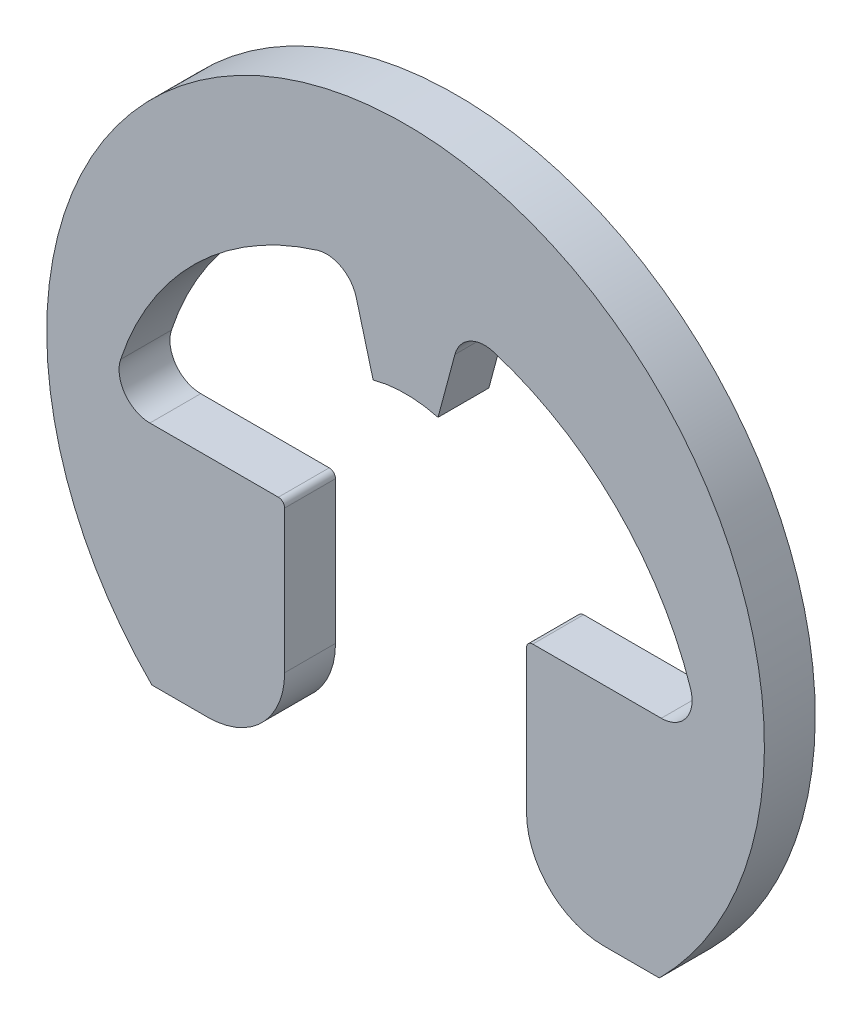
from build123d import *

# Parameters (mm, degrees)
BODY_DEPTH = 0.381


with BuildPart() as part:
    # BodySke → Body (new body)
    with BuildSketch(Plane.XY):
        with BuildLine():
            Line((1.901319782, -1.901319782), (1.483369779, -1.901319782))
            ThreePointArc((1.483369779, -1.901319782), (1.075232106, -1.732263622), (0.906175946, -1.324125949))
            Line((0.906175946, -1.324125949), (0.906175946, -0.255400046))
            ThreePointArc((0.906175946, -0.255400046), (0.919938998, -0.222173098), (0.953165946, -0.208410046))
            Line((0.953165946, -0.208410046), (1.915962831, -0.208410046))
            ThreePointArc((1.915962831, -0.208410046), (2.103022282, -0.112858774), (2.135248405, 0.094705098))
            ThreePointArc((2.135248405, 0.094705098), (1.573634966, 0.996836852), (0.660416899, 1.540237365))
            ThreePointArc((0.660416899, 1.540237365), (0.480808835, 1.521558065), (0.369582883, 1.379302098))
            Line((0.369582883, 1.379302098), (0.243238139, 0.907777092))
            ThreePointArc((0.243238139, 0.907777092), (0, 0.9398), (-0.243238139, 0.907777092))
            Line((-0.243238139, 0.907777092), (-0.369582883, 1.379302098))
            ThreePointArc((-0.369582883, 1.379302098), (-0.480808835, 1.521558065), (-0.660416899, 1.540237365))
            ThreePointArc((-0.660416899, 1.540237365), (-1.573634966, 0.996836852), (-2.135248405, 0.094705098))
            ThreePointArc((-2.135248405, 0.094705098), (-2.103022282, -0.112858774), (-1.915962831, -0.208410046))
            Line((-1.915962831, -0.208410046), (-0.953165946, -0.208410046))
            ThreePointArc((-0.953165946, -0.208410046), (-0.919938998, -0.222173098), (-0.906175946, -0.255400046))
            Line((-0.906175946, -0.255400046), (-0.906175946, -1.324125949))
            ThreePointArc((-0.906175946, -1.324125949), (-1.075232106, -1.732263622), (-1.483369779, -1.901319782))
            Line((-1.483369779, -1.901319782), (-1.901319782, -1.901319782))
            ThreePointArc((-1.901319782, -1.901319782), (0, 2.688872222), (1.901319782, -1.901319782))
        make_face()
    extrude(amount=-BODY_DEPTH)


solid = part.part
